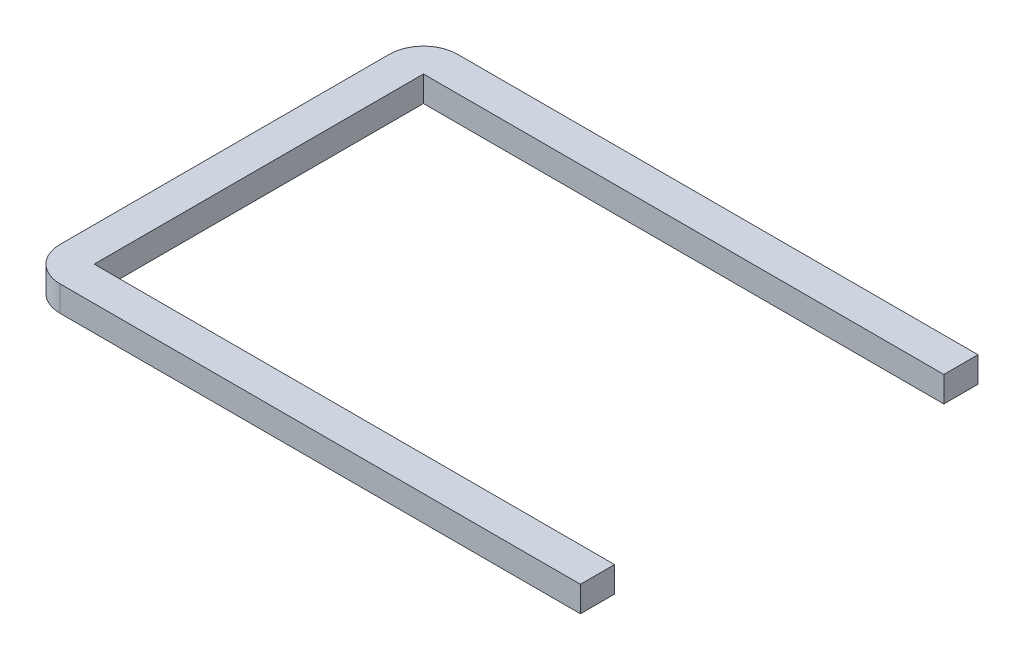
ISO-10303-21;
HEADER;
FILE_DESCRIPTION(('STEP AP214'),'2;1');
FILE_NAME('part.step','',(''),(''),'','','');
FILE_SCHEMA(('AUTOMOTIVE_DESIGN { 1 0 10303 214 1 1 1 1 }'));
ENDSEC;
DATA;
#1=APPLICATION_CONTEXT('core data for automotive mechanical design processes');
#2=APPLICATION_PROTOCOL_DEFINITION('international standard','automotive_design',2000,#1);
#3=PRODUCT_CONTEXT('',#1,'mechanical');
#4=PRODUCT('Part','Part','',(#3));
#5=PRODUCT_RELATED_PRODUCT_CATEGORY('part','',(#4));
#6=PRODUCT_DEFINITION_FORMATION('','',#4);
#7=PRODUCT_DEFINITION_CONTEXT('part definition',#1,'design');
#8=PRODUCT_DEFINITION('design','',#6,#7);
#9=PRODUCT_DEFINITION_SHAPE('','',#8);
#10=(LENGTH_UNIT() NAMED_UNIT(*) SI_UNIT(.MILLI.,.METRE.));
#11=(NAMED_UNIT(*) PLANE_ANGLE_UNIT() SI_UNIT($,.RADIAN.));
#12=(NAMED_UNIT(*) SI_UNIT($,.STERADIAN.) SOLID_ANGLE_UNIT());
#13=UNCERTAINTY_MEASURE_WITH_UNIT(LENGTH_MEASURE(1.E-05),#10,'distance_accuracy_value','');
#14=(GEOMETRIC_REPRESENTATION_CONTEXT(3) GLOBAL_UNCERTAINTY_ASSIGNED_CONTEXT((#13)) GLOBAL_UNIT_ASSIGNED_CONTEXT((#10,
#11,#12)) REPRESENTATION_CONTEXT('',''));
#15=CARTESIAN_POINT('',(0.,0.,0.));
#16=DIRECTION('',(0.,0.,1.));
#17=DIRECTION('',(1.,0.,0.));
#18=AXIS2_PLACEMENT_3D('',#15,#16,#17);
#19=CARTESIAN_POINT('',(0.,7.5,0.));
#20=DIRECTION('',(0.,0.,-1.));
#21=DIRECTION('',(-1.,0.,0.));
#22=AXIS2_PLACEMENT_3D('',#19,#20,#21);
#23=PLANE('',#22);
#24=DIRECTION('',(1.,0.,0.));
#25=VECTOR('',#24,1.);
#26=CARTESIAN_POINT('',(0.,7.5,0.));
#27=LINE('',#26,#25);
#28=CARTESIAN_POINT('',(10.,7.5,0.));
#29=VERTEX_POINT('',#28);
#30=CARTESIAN_POINT('',(162.5,7.5,0.));
#31=VERTEX_POINT('',#30);
#32=EDGE_CURVE('E289',#29,#31,#27,.T.);
#33=ORIENTED_EDGE('',*,*,#32,.F.);
#34=DIRECTION('',(0.,-1.,0.));
#35=VECTOR('',#34,1.);
#36=CARTESIAN_POINT('',(10.,7.5,0.));
#37=LINE('',#36,#35);
#38=CARTESIAN_POINT('',(10.,0.,0.));
#39=VERTEX_POINT('',#38);
#40=EDGE_CURVE('E11',#29,#39,#37,.T.);
#41=ORIENTED_EDGE('',*,*,#40,.T.);
#42=DIRECTION('',(1.,0.,0.));
#43=VECTOR('',#42,1.);
#44=CARTESIAN_POINT('',(0.,0.,0.));
#45=LINE('',#44,#43);
#46=CARTESIAN_POINT('',(162.5,0.,0.));
#47=VERTEX_POINT('',#46);
#48=EDGE_CURVE('E216',#39,#47,#45,.T.);
#49=ORIENTED_EDGE('',*,*,#48,.T.);
#50=DIRECTION('',(0.,-1.,0.));
#51=VECTOR('',#50,1.);
#52=CARTESIAN_POINT('',(162.5,7.5,0.));
#53=LINE('',#52,#51);
#54=EDGE_CURVE('E344',#31,#47,#53,.T.);
#55=ORIENTED_EDGE('',*,*,#54,.F.);
#56=EDGE_LOOP('',(#33,#41,#49,#55));
#57=FACE_BOUND('',#56,.T.);
#58=ADVANCED_FACE('F37',(#57),#23,.F.);
#59=CARTESIAN_POINT('',(162.5,7.5,-10.));
#60=DIRECTION('',(1.,0.,0.));
#61=DIRECTION('',(0.,0.,-1.));
#62=AXIS2_PLACEMENT_3D('',#59,#60,#61);
#63=PLANE('',#62);
#64=DIRECTION('',(0.,0.,1.));
#65=VECTOR('',#64,1.);
#66=CARTESIAN_POINT('',(162.5,0.,-10.));
#67=LINE('',#66,#65);
#68=CARTESIAN_POINT('',(162.5,0.,-10.));
#69=VERTEX_POINT('',#68);
#70=EDGE_CURVE('E315',#69,#47,#67,.T.);
#71=ORIENTED_EDGE('',*,*,#70,.F.);
#72=DIRECTION('',(0.,-1.,0.));
#73=VECTOR('',#72,1.);
#74=CARTESIAN_POINT('',(162.5,7.5,-10.));
#75=LINE('',#74,#73);
#76=CARTESIAN_POINT('',(162.5,7.5,-10.));
#77=VERTEX_POINT('',#76);
#78=EDGE_CURVE('E342',#77,#69,#75,.T.);
#79=ORIENTED_EDGE('',*,*,#78,.F.);
#80=DIRECTION('',(0.,0.,1.));
#81=VECTOR('',#80,1.);
#82=CARTESIAN_POINT('',(162.5,7.5,-10.));
#83=LINE('',#82,#81);
#84=EDGE_CURVE('E291',#77,#31,#83,.T.);
#85=ORIENTED_EDGE('',*,*,#84,.T.);
#86=ORIENTED_EDGE('',*,*,#54,.T.);
#87=EDGE_LOOP('',(#71,#79,#85,#86));
#88=FACE_BOUND('',#87,.T.);
#89=ADVANCED_FACE('F396',(#88),#63,.T.);
#90=CARTESIAN_POINT('',(0.,7.5,-10.));
#91=DIRECTION('',(0.,0.,-1.));
#92=DIRECTION('',(-1.,0.,0.));
#93=AXIS2_PLACEMENT_3D('',#90,#91,#92);
#94=PLANE('',#93);
#95=DIRECTION('',(1.,0.,0.));
#96=VECTOR('',#95,1.);
#97=CARTESIAN_POINT('',(0.,0.,-10.));
#98=LINE('',#97,#96);
#99=CARTESIAN_POINT('',(10.,0.,-10.));
#100=VERTEX_POINT('',#99);
#101=EDGE_CURVE('E318',#100,#69,#98,.T.);
#102=ORIENTED_EDGE('',*,*,#101,.F.);
#103=DIRECTION('',(0.,-1.,0.));
#104=VECTOR('',#103,1.);
#105=CARTESIAN_POINT('',(10.,7.5,-10.));
#106=LINE('',#105,#104);
#107=CARTESIAN_POINT('',(10.,7.5,-10.));
#108=VERTEX_POINT('',#107);
#109=EDGE_CURVE('E340',#108,#100,#106,.T.);
#110=ORIENTED_EDGE('',*,*,#109,.F.);
#111=DIRECTION('',(1.,0.,0.));
#112=VECTOR('',#111,1.);
#113=CARTESIAN_POINT('',(0.,7.5,-10.));
#114=LINE('',#113,#112);
#115=EDGE_CURVE('E295',#108,#77,#114,.T.);
#116=ORIENTED_EDGE('',*,*,#115,.T.);
#117=ORIENTED_EDGE('',*,*,#78,.T.);
#118=EDGE_LOOP('',(#102,#110,#116,#117));
#119=FACE_BOUND('',#118,.T.);
#120=ADVANCED_FACE('F392',(#119),#94,.T.);
#121=CARTESIAN_POINT('',(10.,7.5,0.));
#122=DIRECTION('',(1.,0.,0.));
#123=DIRECTION('',(0.,0.,-1.));
#124=AXIS2_PLACEMENT_3D('',#121,#122,#123);
#125=PLANE('',#124);
#126=DIRECTION('',(0.,0.,-1.));
#127=VECTOR('',#126,1.);
#128=CARTESIAN_POINT('',(10.,0.,0.));
#129=LINE('',#128,#127);
#130=CARTESIAN_POINT('',(10.,0.,-106.5));
#131=VERTEX_POINT('',#130);
#132=EDGE_CURVE('E321',#131,#100,#129,.F.);
#133=ORIENTED_EDGE('',*,*,#132,.F.);
#134=DIRECTION('',(0.,-1.,0.));
#135=VECTOR('',#134,1.);
#136=CARTESIAN_POINT('',(10.,7.5,-106.5));
#137=LINE('',#136,#135);
#138=CARTESIAN_POINT('',(10.,7.5,-106.5));
#139=VERTEX_POINT('',#138);
#140=EDGE_CURVE('E338',#139,#131,#137,.T.);
#141=ORIENTED_EDGE('',*,*,#140,.F.);
#142=DIRECTION('',(0.,0.,-1.));
#143=VECTOR('',#142,1.);
#144=CARTESIAN_POINT('',(10.,7.5,0.));
#145=LINE('',#144,#143);
#146=EDGE_CURVE('E298',#139,#108,#145,.F.);
#147=ORIENTED_EDGE('',*,*,#146,.T.);
#148=ORIENTED_EDGE('',*,*,#109,.T.);
#149=EDGE_LOOP('',(#133,#141,#147,#148));
#150=FACE_BOUND('',#149,.T.);
#151=ADVANCED_FACE('F388',(#150),#125,.T.);
#152=CARTESIAN_POINT('',(0.,7.5,-106.5));
#153=DIRECTION('',(0.,0.,1.));
#154=DIRECTION('',(1.,0.,0.));
#155=AXIS2_PLACEMENT_3D('',#152,#153,#154);
#156=PLANE('',#155);
#157=DIRECTION('',(1.,0.,0.));
#158=VECTOR('',#157,1.);
#159=CARTESIAN_POINT('',(0.,0.,-106.5));
#160=LINE('',#159,#158);
#161=CARTESIAN_POINT('',(162.5,0.,-106.5));
#162=VERTEX_POINT('',#161);
#163=EDGE_CURVE('E324',#162,#131,#160,.F.);
#164=ORIENTED_EDGE('',*,*,#163,.F.);
#165=DIRECTION('',(0.,-1.,0.));
#166=VECTOR('',#165,1.);
#167=CARTESIAN_POINT('',(162.5,7.5,-106.5));
#168=LINE('',#167,#166);
#169=CARTESIAN_POINT('',(162.5,7.5,-106.5));
#170=VERTEX_POINT('',#169);
#171=EDGE_CURVE('E336',#170,#162,#168,.T.);
#172=ORIENTED_EDGE('',*,*,#171,.F.);
#173=DIRECTION('',(1.,0.,0.));
#174=VECTOR('',#173,1.);
#175=CARTESIAN_POINT('',(0.,7.5,-106.5));
#176=LINE('',#175,#174);
#177=EDGE_CURVE('E301',#170,#139,#176,.F.);
#178=ORIENTED_EDGE('',*,*,#177,.T.);
#179=ORIENTED_EDGE('',*,*,#140,.T.);
#180=EDGE_LOOP('',(#164,#172,#178,#179));
#181=FACE_BOUND('',#180,.T.);
#182=ADVANCED_FACE('F384',(#181),#156,.T.);
#183=CARTESIAN_POINT('',(162.5,7.5,-116.5));
#184=DIRECTION('',(1.,0.,0.));
#185=DIRECTION('',(0.,0.,-1.));
#186=AXIS2_PLACEMENT_3D('',#183,#184,#185);
#187=PLANE('',#186);
#188=DIRECTION('',(0.,0.,1.));
#189=VECTOR('',#188,1.);
#190=CARTESIAN_POINT('',(162.5,0.,-116.5));
#191=LINE('',#190,#189);
#192=CARTESIAN_POINT('',(162.5,0.,-116.5));
#193=VERTEX_POINT('',#192);
#194=EDGE_CURVE('E327',#193,#162,#191,.T.);
#195=ORIENTED_EDGE('',*,*,#194,.F.);
#196=DIRECTION('',(0.,-1.,0.));
#197=VECTOR('',#196,1.);
#198=CARTESIAN_POINT('',(162.5,7.5,-116.5));
#199=LINE('',#198,#197);
#200=CARTESIAN_POINT('',(162.5,7.5,-116.5));
#201=VERTEX_POINT('',#200);
#202=EDGE_CURVE('E313',#201,#193,#199,.T.);
#203=ORIENTED_EDGE('',*,*,#202,.F.);
#204=DIRECTION('',(0.,0.,1.));
#205=VECTOR('',#204,1.);
#206=CARTESIAN_POINT('',(162.5,7.5,-116.5));
#207=LINE('',#206,#205);
#208=EDGE_CURVE('E304',#201,#170,#207,.T.);
#209=ORIENTED_EDGE('',*,*,#208,.T.);
#210=ORIENTED_EDGE('',*,*,#171,.T.);
#211=EDGE_LOOP('',(#195,#203,#209,#210));
#212=FACE_BOUND('',#211,.T.);
#213=ADVANCED_FACE('F380',(#212),#187,.T.);
#214=CARTESIAN_POINT('',(0.,7.5,-116.5));
#215=DIRECTION('',(0.,0.,1.));
#216=DIRECTION('',(1.,0.,0.));
#217=AXIS2_PLACEMENT_3D('',#214,#215,#216);
#218=PLANE('',#217);
#219=DIRECTION('',(-1.,0.,0.));
#220=VECTOR('',#219,1.);
#221=CARTESIAN_POINT('',(0.,0.,-116.5));
#222=LINE('',#221,#220);
#223=CARTESIAN_POINT('',(10.,0.,-116.5));
#224=VERTEX_POINT('',#223);
#225=EDGE_CURVE('E330',#193,#224,#222,.T.);
#226=ORIENTED_EDGE('',*,*,#225,.T.);
#227=DIRECTION('',(0.,-1.,0.));
#228=VECTOR('',#227,1.);
#229=CARTESIAN_POINT('',(10.,7.5,-116.5));
#230=LINE('',#229,#228);
#231=CARTESIAN_POINT('',(10.,7.5,-116.5));
#232=VERTEX_POINT('',#231);
#233=EDGE_CURVE('E356',#224,#232,#230,.F.);
#234=ORIENTED_EDGE('',*,*,#233,.T.);
#235=DIRECTION('',(-1.,0.,0.));
#236=VECTOR('',#235,1.);
#237=CARTESIAN_POINT('',(0.,7.5,-116.5));
#238=LINE('',#237,#236);
#239=EDGE_CURVE('E307',#201,#232,#238,.T.);
#240=ORIENTED_EDGE('',*,*,#239,.F.);
#241=ORIENTED_EDGE('',*,*,#202,.T.);
#242=EDGE_LOOP('',(#226,#234,#240,#241));
#243=FACE_BOUND('',#242,.T.);
#244=ADVANCED_FACE('F378',(#243),#218,.F.);
#245=CARTESIAN_POINT('',(0.,7.5,0.));
#246=DIRECTION('',(1.,0.,0.));
#247=DIRECTION('',(0.,0.,-1.));
#248=AXIS2_PLACEMENT_3D('',#245,#246,#247);
#249=PLANE('',#248);
#250=DIRECTION('',(0.,0.,1.));
#251=VECTOR('',#250,1.);
#252=CARTESIAN_POINT('',(0.,7.5,0.));
#253=LINE('',#252,#251);
#254=CARTESIAN_POINT('',(0.,7.5,-106.5));
#255=VERTEX_POINT('',#254);
#256=CARTESIAN_POINT('',(0.,7.5,-10.));
#257=VERTEX_POINT('',#256);
#258=EDGE_CURVE('E310',#255,#257,#253,.T.);
#259=ORIENTED_EDGE('',*,*,#258,.F.);
#260=DIRECTION('',(0.,-1.,0.));
#261=VECTOR('',#260,1.);
#262=CARTESIAN_POINT('',(0.,7.5,-106.5));
#263=LINE('',#262,#261);
#264=CARTESIAN_POINT('',(0.,0.,-106.5));
#265=VERTEX_POINT('',#264);
#266=EDGE_CURVE('E349',#255,#265,#263,.T.);
#267=ORIENTED_EDGE('',*,*,#266,.T.);
#268=DIRECTION('',(0.,0.,1.));
#269=VECTOR('',#268,1.);
#270=CARTESIAN_POINT('',(0.,0.,0.));
#271=LINE('',#270,#269);
#272=CARTESIAN_POINT('',(0.,0.,-10.));
#273=VERTEX_POINT('',#272);
#274=EDGE_CURVE('E292',#265,#273,#271,.T.);
#275=ORIENTED_EDGE('',*,*,#274,.T.);
#276=DIRECTION('',(0.,-1.,0.));
#277=VECTOR('',#276,1.);
#278=CARTESIAN_POINT('',(0.,7.5,-10.));
#279=LINE('',#278,#277);
#280=EDGE_CURVE('E347',#273,#257,#279,.F.);
#281=ORIENTED_EDGE('',*,*,#280,.T.);
#282=EDGE_LOOP('',(#259,#267,#275,#281));
#283=FACE_BOUND('',#282,.T.);
#284=ADVANCED_FACE('F370',(#283),#249,.F.);
#285=CARTESIAN_POINT('',(0.,7.5,0.));
#286=DIRECTION('',(0.,-1.,0.));
#287=DIRECTION('',(-1.,0.,0.));
#288=AXIS2_PLACEMENT_3D('',#285,#286,#287);
#289=PLANE('',#288);
#290=ORIENTED_EDGE('',*,*,#239,.T.);
#291=CARTESIAN_POINT('',(10.,7.5,-106.5));
#292=DIRECTION('',(0.,-1.,0.));
#293=DIRECTION('',(0.,0.,-1.));
#294=AXIS2_PLACEMENT_3D('',#291,#292,#293);
#295=CIRCLE('',#294,10.);
#296=EDGE_CURVE('E45',#232,#255,#295,.F.);
#297=ORIENTED_EDGE('',*,*,#296,.T.);
#298=ORIENTED_EDGE('',*,*,#258,.T.);
#299=CARTESIAN_POINT('',(10.,7.5,-10.));
#300=DIRECTION('',(0.,-1.,0.));
#301=DIRECTION('',(0.,0.,-1.));
#302=AXIS2_PLACEMENT_3D('',#299,#300,#301);
#303=CIRCLE('',#302,10.);
#304=EDGE_CURVE('E358',#257,#29,#303,.F.);
#305=ORIENTED_EDGE('',*,*,#304,.T.);
#306=ORIENTED_EDGE('',*,*,#32,.T.);
#307=ORIENTED_EDGE('',*,*,#84,.F.);
#308=ORIENTED_EDGE('',*,*,#115,.F.);
#309=ORIENTED_EDGE('',*,*,#146,.F.);
#310=ORIENTED_EDGE('',*,*,#177,.F.);
#311=ORIENTED_EDGE('',*,*,#208,.F.);
#312=EDGE_LOOP('',(#290,#297,#298,#305,#306,#307,#308,#309,#310,#311));
#313=FACE_BOUND('',#312,.T.);
#314=ADVANCED_FACE('F362',(#313),#289,.F.);
#315=CARTESIAN_POINT('',(0.,0.,0.));
#316=DIRECTION('',(0.,-1.,0.));
#317=DIRECTION('',(-1.,0.,0.));
#318=AXIS2_PLACEMENT_3D('',#315,#316,#317);
#319=PLANE('',#318);
#320=DIRECTION('',(0.,0.,-1.));
#321=VECTOR('',#320,1.);
#322=CARTESIAN_POINT('',(72.5,0.,-2.5));
#323=LINE('',#322,#321);
#324=CARTESIAN_POINT('',(72.5,0.,-2.5));
#325=VERTEX_POINT('',#324);
#326=CARTESIAN_POINT('',(72.5,0.,-7.5));
#327=VERTEX_POINT('',#326);
#328=EDGE_CURVE('E52',#325,#327,#323,.T.);
#329=ORIENTED_EDGE('',*,*,#328,.F.);
#330=DIRECTION('',(-1.,0.,0.));
#331=VECTOR('',#330,1.);
#332=CARTESIAN_POINT('',(72.5,0.,-2.5));
#333=LINE('',#332,#331);
#334=CARTESIAN_POINT('',(122.5,0.,-2.5));
#335=VERTEX_POINT('',#334);
#336=EDGE_CURVE('E208',#335,#325,#333,.T.);
#337=ORIENTED_EDGE('',*,*,#336,.F.);
#338=DIRECTION('',(0.,0.,1.));
#339=VECTOR('',#338,1.);
#340=CARTESIAN_POINT('',(122.5,0.,-2.5));
#341=LINE('',#340,#339);
#342=CARTESIAN_POINT('',(122.5,0.,-7.5));
#343=VERTEX_POINT('',#342);
#344=EDGE_CURVE('E190',#343,#335,#341,.T.);
#345=ORIENTED_EDGE('',*,*,#344,.F.);
#346=DIRECTION('',(1.,0.,0.));
#347=VECTOR('',#346,1.);
#348=CARTESIAN_POINT('',(72.5,0.,-7.5));
#349=LINE('',#348,#347);
#350=EDGE_CURVE('E201',#327,#343,#349,.T.);
#351=ORIENTED_EDGE('',*,*,#350,.F.);
#352=EDGE_LOOP('',(#329,#337,#345,#351));
#353=FACE_BOUND('',#352,.T.);
#354=DIRECTION('',(0.,0.,-1.));
#355=VECTOR('',#354,1.);
#356=CARTESIAN_POINT('',(2.49999999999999,0.,-33.25));
#357=LINE('',#356,#355);
#358=CARTESIAN_POINT('',(2.49999999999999,0.,-33.25));
#359=VERTEX_POINT('',#358);
#360=CARTESIAN_POINT('',(2.49999999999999,0.,-83.25));
#361=VERTEX_POINT('',#360);
#362=EDGE_CURVE('E60',#359,#361,#357,.T.);
#363=ORIENTED_EDGE('',*,*,#362,.F.);
#364=DIRECTION('',(-1.,0.,0.));
#365=VECTOR('',#364,1.);
#366=CARTESIAN_POINT('',(2.49999999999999,0.,-33.25));
#367=LINE('',#366,#365);
#368=CARTESIAN_POINT('',(7.49999999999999,0.,-33.25));
#369=VERTEX_POINT('',#368);
#370=EDGE_CURVE('E240',#369,#359,#367,.T.);
#371=ORIENTED_EDGE('',*,*,#370,.F.);
#372=DIRECTION('',(0.,0.,1.));
#373=VECTOR('',#372,1.);
#374=CARTESIAN_POINT('',(7.49999999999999,0.,-33.25));
#375=LINE('',#374,#373);
#376=CARTESIAN_POINT('',(7.49999999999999,0.,-83.25));
#377=VERTEX_POINT('',#376);
#378=EDGE_CURVE('E251',#377,#369,#375,.T.);
#379=ORIENTED_EDGE('',*,*,#378,.F.);
#380=DIRECTION('',(1.,0.,0.));
#381=VECTOR('',#380,1.);
#382=CARTESIAN_POINT('',(2.49999999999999,0.,-83.25));
#383=LINE('',#382,#381);
#384=EDGE_CURVE('E254',#361,#377,#383,.T.);
#385=ORIENTED_EDGE('',*,*,#384,.F.);
#386=EDGE_LOOP('',(#363,#371,#379,#385));
#387=FACE_BOUND('',#386,.T.);
#388=DIRECTION('',(0.,0.,-1.));
#389=VECTOR('',#388,1.);
#390=CARTESIAN_POINT('',(72.5,0.,-109.));
#391=LINE('',#390,#389);
#392=CARTESIAN_POINT('',(72.5,0.,-109.));
#393=VERTEX_POINT('',#392);
#394=CARTESIAN_POINT('',(72.5,0.,-114.));
#395=VERTEX_POINT('',#394);
#396=EDGE_CURVE('E248',#393,#395,#391,.T.);
#397=ORIENTED_EDGE('',*,*,#396,.F.);
#398=DIRECTION('',(-1.,0.,0.));
#399=VECTOR('',#398,1.);
#400=CARTESIAN_POINT('',(72.5,0.,-109.));
#401=LINE('',#400,#399);
#402=CARTESIAN_POINT('',(122.5,0.,-109.));
#403=VERTEX_POINT('',#402);
#404=EDGE_CURVE('E271',#403,#393,#401,.T.);
#405=ORIENTED_EDGE('',*,*,#404,.F.);
#406=DIRECTION('',(0.,0.,1.));
#407=VECTOR('',#406,1.);
#408=CARTESIAN_POINT('',(122.5,0.,-109.));
#409=LINE('',#408,#407);
#410=CARTESIAN_POINT('',(122.5,0.,-114.));
#411=VERTEX_POINT('',#410);
#412=EDGE_CURVE('E282',#411,#403,#409,.T.);
#413=ORIENTED_EDGE('',*,*,#412,.F.);
#414=DIRECTION('',(1.,0.,0.));
#415=VECTOR('',#414,1.);
#416=CARTESIAN_POINT('',(72.5,0.,-114.));
#417=LINE('',#416,#415);
#418=EDGE_CURVE('E285',#395,#411,#417,.T.);
#419=ORIENTED_EDGE('',*,*,#418,.F.);
#420=EDGE_LOOP('',(#397,#405,#413,#419));
#421=FACE_BOUND('',#420,.T.);
#422=ORIENTED_EDGE('',*,*,#274,.F.);
#423=CARTESIAN_POINT('',(10.,0.,-106.5));
#424=DIRECTION('',(0.,-1.,0.));
#425=DIRECTION('',(0.,0.,-1.));
#426=AXIS2_PLACEMENT_3D('',#423,#424,#425);
#427=CIRCLE('',#426,10.);
#428=EDGE_CURVE('E354',#265,#224,#427,.T.);
#429=ORIENTED_EDGE('',*,*,#428,.T.);
#430=ORIENTED_EDGE('',*,*,#225,.F.);
#431=ORIENTED_EDGE('',*,*,#194,.T.);
#432=ORIENTED_EDGE('',*,*,#163,.T.);
#433=ORIENTED_EDGE('',*,*,#132,.T.);
#434=ORIENTED_EDGE('',*,*,#101,.T.);
#435=ORIENTED_EDGE('',*,*,#70,.T.);
#436=ORIENTED_EDGE('',*,*,#48,.F.);
#437=CARTESIAN_POINT('',(10.,0.,-10.));
#438=DIRECTION('',(0.,-1.,0.));
#439=DIRECTION('',(0.,0.,-1.));
#440=AXIS2_PLACEMENT_3D('',#437,#438,#439);
#441=CIRCLE('',#440,10.);
#442=EDGE_CURVE('E352',#39,#273,#441,.T.);
#443=ORIENTED_EDGE('',*,*,#442,.T.);
#444=EDGE_LOOP('',(#422,#429,#430,#431,#432,#433,#434,#435,#436,#443));
#445=FACE_BOUND('',#444,.T.);
#446=ADVANCED_FACE('F205',(#353,#387,#421,#445),#319,.T.);
#447=CARTESIAN_POINT('',(10.,7.5,-106.5));
#448=DIRECTION('',(0.,-1.,0.));
#449=DIRECTION('',(0.,0.,-1.));
#450=AXIS2_PLACEMENT_3D('',#447,#448,#449);
#451=CYLINDRICAL_SURFACE('',#450,10.);
#452=ORIENTED_EDGE('',*,*,#296,.F.);
#453=ORIENTED_EDGE('',*,*,#233,.F.);
#454=ORIENTED_EDGE('',*,*,#428,.F.);
#455=ORIENTED_EDGE('',*,*,#266,.F.);
#456=EDGE_LOOP('',(#452,#453,#454,#455));
#457=FACE_BOUND('',#456,.T.);
#458=ADVANCED_FACE('F373',(#457),#451,.T.);
#459=CARTESIAN_POINT('',(10.,7.5,-10.));
#460=DIRECTION('',(0.,-1.,0.));
#461=DIRECTION('',(0.,0.,-1.));
#462=AXIS2_PLACEMENT_3D('',#459,#460,#461);
#463=CYLINDRICAL_SURFACE('',#462,10.);
#464=ORIENTED_EDGE('',*,*,#304,.F.);
#465=ORIENTED_EDGE('',*,*,#280,.F.);
#466=ORIENTED_EDGE('',*,*,#442,.F.);
#467=ORIENTED_EDGE('',*,*,#40,.F.);
#468=EDGE_LOOP('',(#464,#465,#466,#467));
#469=FACE_BOUND('',#468,.T.);
#470=ADVANCED_FACE('F39',(#469),#463,.T.);
#471=CARTESIAN_POINT('',(72.5,0.,-109.));
#472=DIRECTION('',(-0.707106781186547,0.707106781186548,0.));
#473=DIRECTION('',(-0.707106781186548,-0.707106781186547,0.));
#474=AXIS2_PLACEMENT_3D('',#471,#472,#473);
#475=PLANE('',#474);
#476=ORIENTED_EDGE('',*,*,#396,.T.);
#477=DIRECTION('',(-0.577350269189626,-0.577350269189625,-0.577350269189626));
#478=VECTOR('',#477,1.);
#479=CARTESIAN_POINT('',(74.1666666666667,1.66666666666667,-112.333333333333));
#480=LINE('',#479,#478);
#481=CARTESIAN_POINT('',(74.6,2.1,-111.9));
#482=VERTEX_POINT('',#481);
#483=EDGE_CURVE('E268',#482,#395,#480,.T.);
#484=ORIENTED_EDGE('',*,*,#483,.F.);
#485=DIRECTION('',(0.,0.,-1.));
#486=VECTOR('',#485,1.);
#487=CARTESIAN_POINT('',(74.6,2.1,0.));
#488=LINE('',#487,#486);
#489=CARTESIAN_POINT('',(74.6,2.1,-111.1));
#490=VERTEX_POINT('',#489);
#491=EDGE_CURVE('E261',#490,#482,#488,.T.);
#492=ORIENTED_EDGE('',*,*,#491,.F.);
#493=DIRECTION('',(-0.577350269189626,-0.577350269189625,0.577350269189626));
#494=VECTOR('',#493,1.);
#495=CARTESIAN_POINT('',(72.5,0.,-109.));
#496=LINE('',#495,#494);
#497=EDGE_CURVE('E275',#490,#393,#496,.T.);
#498=ORIENTED_EDGE('',*,*,#497,.T.);
#499=EDGE_LOOP('',(#476,#484,#492,#498));
#500=FACE_BOUND('',#499,.T.);
#501=ADVANCED_FACE('F404',(#500),#475,.F.);
#502=CARTESIAN_POINT('',(72.5,0.,-109.));
#503=DIRECTION('',(0.,0.707106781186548,0.707106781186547));
#504=DIRECTION('',(0.,-0.707106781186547,0.707106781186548));
#505=AXIS2_PLACEMENT_3D('',#502,#503,#504);
#506=PLANE('',#505);
#507=ORIENTED_EDGE('',*,*,#404,.T.);
#508=ORIENTED_EDGE('',*,*,#497,.F.);
#509=DIRECTION('',(-1.,0.,0.));
#510=VECTOR('',#509,1.);
#511=CARTESIAN_POINT('',(0.,2.1,-111.1));
#512=LINE('',#511,#510);
#513=CARTESIAN_POINT('',(120.4,2.1,-111.1));
#514=VERTEX_POINT('',#513);
#515=EDGE_CURVE('E265',#514,#490,#512,.T.);
#516=ORIENTED_EDGE('',*,*,#515,.F.);
#517=DIRECTION('',(0.577350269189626,-0.577350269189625,0.577350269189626));
#518=VECTOR('',#517,1.);
#519=CARTESIAN_POINT('',(122.5,0.,-109.));
#520=LINE('',#519,#518);
#521=EDGE_CURVE('E272',#514,#403,#520,.T.);
#522=ORIENTED_EDGE('',*,*,#521,.T.);
#523=EDGE_LOOP('',(#507,#508,#516,#522));
#524=FACE_BOUND('',#523,.T.);
#525=ADVANCED_FACE('F409',(#524),#506,.F.);
#526=CARTESIAN_POINT('',(122.5,0.,-109.));
#527=DIRECTION('',(0.707106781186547,0.707106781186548,0.));
#528=DIRECTION('',(-0.707106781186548,0.707106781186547,0.));
#529=AXIS2_PLACEMENT_3D('',#526,#527,#528);
#530=PLANE('',#529);
#531=ORIENTED_EDGE('',*,*,#412,.T.);
#532=ORIENTED_EDGE('',*,*,#521,.F.);
#533=DIRECTION('',(0.,0.,1.));
#534=VECTOR('',#533,1.);
#535=CARTESIAN_POINT('',(120.4,2.1,0.));
#536=LINE('',#535,#534);
#537=CARTESIAN_POINT('',(120.4,2.1,-111.9));
#538=VERTEX_POINT('',#537);
#539=EDGE_CURVE('E262',#538,#514,#536,.T.);
#540=ORIENTED_EDGE('',*,*,#539,.F.);
#541=DIRECTION('',(0.577350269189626,-0.577350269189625,-0.577350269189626));
#542=VECTOR('',#541,1.);
#543=CARTESIAN_POINT('',(105.833333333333,16.6666666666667,-97.3333333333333));
#544=LINE('',#543,#542);
#545=EDGE_CURVE('E274',#538,#411,#544,.T.);
#546=ORIENTED_EDGE('',*,*,#545,.T.);
#547=EDGE_LOOP('',(#531,#532,#540,#546));
#548=FACE_BOUND('',#547,.T.);
#549=ADVANCED_FACE('F443',(#548),#530,.F.);
#550=CARTESIAN_POINT('',(72.5,0.,-114.));
#551=DIRECTION('',(0.,0.707106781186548,-0.707106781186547));
#552=DIRECTION('',(0.,0.707106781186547,0.707106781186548));
#553=AXIS2_PLACEMENT_3D('',#550,#551,#552);
#554=PLANE('',#553);
#555=ORIENTED_EDGE('',*,*,#418,.T.);
#556=ORIENTED_EDGE('',*,*,#545,.F.);
#557=DIRECTION('',(1.,0.,0.));
#558=VECTOR('',#557,1.);
#559=CARTESIAN_POINT('',(0.,2.1,-111.9));
#560=LINE('',#559,#558);
#561=EDGE_CURVE('E258',#482,#538,#560,.T.);
#562=ORIENTED_EDGE('',*,*,#561,.F.);
#563=ORIENTED_EDGE('',*,*,#483,.T.);
#564=EDGE_LOOP('',(#555,#556,#562,#563));
#565=FACE_BOUND('',#564,.T.);
#566=ADVANCED_FACE('F438',(#565),#554,.F.);
#567=CARTESIAN_POINT('',(0.,2.1,0.));
#568=DIRECTION('',(0.,-1.,0.));
#569=DIRECTION('',(0.,0.,-1.));
#570=AXIS2_PLACEMENT_3D('',#567,#568,#569);
#571=PLANE('',#570);
#572=ORIENTED_EDGE('',*,*,#491,.T.);
#573=ORIENTED_EDGE('',*,*,#561,.T.);
#574=ORIENTED_EDGE('',*,*,#539,.T.);
#575=ORIENTED_EDGE('',*,*,#515,.T.);
#576=EDGE_LOOP('',(#572,#573,#574,#575));
#577=FACE_BOUND('',#576,.T.);
#578=ADVANCED_FACE('F435',(#577),#571,.T.);
#579=CARTESIAN_POINT('',(2.49999999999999,0.,-33.25));
#580=DIRECTION('',(-0.707106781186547,0.707106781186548,0.));
#581=DIRECTION('',(-0.707106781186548,-0.707106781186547,0.));
#582=AXIS2_PLACEMENT_3D('',#579,#580,#581);
#583=PLANE('',#582);
#584=ORIENTED_EDGE('',*,*,#362,.T.);
#585=DIRECTION('',(-0.577350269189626,-0.577350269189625,-0.577350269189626));
#586=VECTOR('',#585,1.);
#587=CARTESIAN_POINT('',(19.1666666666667,16.6666666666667,-66.5833333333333));
#588=LINE('',#587,#586);
#589=CARTESIAN_POINT('',(4.59999999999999,2.1,-81.15));
#590=VERTEX_POINT('',#589);
#591=EDGE_CURVE('E237',#590,#361,#588,.T.);
#592=ORIENTED_EDGE('',*,*,#591,.F.);
#593=DIRECTION('',(0.,0.,-1.));
#594=VECTOR('',#593,1.);
#595=CARTESIAN_POINT('',(4.59999999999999,2.1,0.));
#596=LINE('',#595,#594);
#597=CARTESIAN_POINT('',(4.59999999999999,2.1,-35.35));
#598=VERTEX_POINT('',#597);
#599=EDGE_CURVE('E230',#598,#590,#596,.T.);
#600=ORIENTED_EDGE('',*,*,#599,.F.);
#601=DIRECTION('',(-0.577350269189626,-0.577350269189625,0.577350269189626));
#602=VECTOR('',#601,1.);
#603=CARTESIAN_POINT('',(2.49999999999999,0.,-33.25));
#604=LINE('',#603,#602);
#605=EDGE_CURVE('E244',#598,#359,#604,.T.);
#606=ORIENTED_EDGE('',*,*,#605,.T.);
#607=EDGE_LOOP('',(#584,#592,#600,#606));
#608=FACE_BOUND('',#607,.T.);
#609=ADVANCED_FACE('F437',(#608),#583,.F.);
#610=CARTESIAN_POINT('',(2.49999999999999,0.,-33.25));
#611=DIRECTION('',(0.,0.707106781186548,0.707106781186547));
#612=DIRECTION('',(0.,-0.707106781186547,0.707106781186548));
#613=AXIS2_PLACEMENT_3D('',#610,#611,#612);
#614=PLANE('',#613);
#615=ORIENTED_EDGE('',*,*,#370,.T.);
#616=ORIENTED_EDGE('',*,*,#605,.F.);
#617=DIRECTION('',(-1.,0.,0.));
#618=VECTOR('',#617,1.);
#619=CARTESIAN_POINT('',(0.,2.1,-35.35));
#620=LINE('',#619,#618);
#621=CARTESIAN_POINT('',(5.39999999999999,2.1,-35.35));
#622=VERTEX_POINT('',#621);
#623=EDGE_CURVE('E234',#622,#598,#620,.T.);
#624=ORIENTED_EDGE('',*,*,#623,.F.);
#625=DIRECTION('',(0.577350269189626,-0.577350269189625,0.577350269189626));
#626=VECTOR('',#625,1.);
#627=CARTESIAN_POINT('',(7.49999999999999,0.,-33.25));
#628=LINE('',#627,#626);
#629=EDGE_CURVE('E241',#622,#369,#628,.T.);
#630=ORIENTED_EDGE('',*,*,#629,.T.);
#631=EDGE_LOOP('',(#615,#616,#624,#630));
#632=FACE_BOUND('',#631,.T.);
#633=ADVANCED_FACE('F459',(#632),#614,.F.);
#634=CARTESIAN_POINT('',(7.49999999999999,0.,-33.25));
#635=DIRECTION('',(0.707106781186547,0.707106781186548,0.));
#636=DIRECTION('',(-0.707106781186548,0.707106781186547,0.));
#637=AXIS2_PLACEMENT_3D('',#634,#635,#636);
#638=PLANE('',#637);
#639=ORIENTED_EDGE('',*,*,#378,.T.);
#640=ORIENTED_EDGE('',*,*,#629,.F.);
#641=DIRECTION('',(0.,0.,1.));
#642=VECTOR('',#641,1.);
#643=CARTESIAN_POINT('',(5.39999999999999,2.1,0.));
#644=LINE('',#643,#642);
#645=CARTESIAN_POINT('',(5.39999999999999,2.1,-81.15));
#646=VERTEX_POINT('',#645);
#647=EDGE_CURVE('E231',#646,#622,#644,.T.);
#648=ORIENTED_EDGE('',*,*,#647,.F.);
#649=DIRECTION('',(0.577350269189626,-0.577350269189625,-0.577350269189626));
#650=VECTOR('',#649,1.);
#651=CARTESIAN_POINT('',(5.83333333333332,1.66666666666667,-81.5833333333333));
#652=LINE('',#651,#650);
#653=EDGE_CURVE('E243',#646,#377,#652,.T.);
#654=ORIENTED_EDGE('',*,*,#653,.T.);
#655=EDGE_LOOP('',(#639,#640,#648,#654));
#656=FACE_BOUND('',#655,.T.);
#657=ADVANCED_FACE('F462',(#656),#638,.F.);
#658=CARTESIAN_POINT('',(2.49999999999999,0.,-83.25));
#659=DIRECTION('',(0.,0.707106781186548,-0.707106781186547));
#660=DIRECTION('',(0.,0.707106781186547,0.707106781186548));
#661=AXIS2_PLACEMENT_3D('',#658,#659,#660);
#662=PLANE('',#661);
#663=ORIENTED_EDGE('',*,*,#384,.T.);
#664=ORIENTED_EDGE('',*,*,#653,.F.);
#665=DIRECTION('',(1.,0.,0.));
#666=VECTOR('',#665,1.);
#667=CARTESIAN_POINT('',(0.,2.1,-81.15));
#668=LINE('',#667,#666);
#669=EDGE_CURVE('E227',#590,#646,#668,.T.);
#670=ORIENTED_EDGE('',*,*,#669,.F.);
#671=ORIENTED_EDGE('',*,*,#591,.T.);
#672=EDGE_LOOP('',(#663,#664,#670,#671));
#673=FACE_BOUND('',#672,.T.);
#674=ADVANCED_FACE('F455',(#673),#662,.F.);
#675=CARTESIAN_POINT('',(0.,2.1,0.));
#676=DIRECTION('',(0.,-1.,0.));
#677=DIRECTION('',(0.,0.,-1.));
#678=AXIS2_PLACEMENT_3D('',#675,#676,#677);
#679=PLANE('',#678);
#680=ORIENTED_EDGE('',*,*,#599,.T.);
#681=ORIENTED_EDGE('',*,*,#669,.T.);
#682=ORIENTED_EDGE('',*,*,#647,.T.);
#683=ORIENTED_EDGE('',*,*,#623,.T.);
#684=EDGE_LOOP('',(#680,#681,#682,#683));
#685=FACE_BOUND('',#684,.T.);
#686=ADVANCED_FACE('F451',(#685),#679,.T.);
#687=CARTESIAN_POINT('',(72.5,0.,-2.5));
#688=DIRECTION('',(-0.707106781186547,0.707106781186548,0.));
#689=DIRECTION('',(-0.707106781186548,-0.707106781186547,0.));
#690=AXIS2_PLACEMENT_3D('',#687,#688,#689);
#691=PLANE('',#690);
#692=ORIENTED_EDGE('',*,*,#328,.T.);
#693=DIRECTION('',(-0.577350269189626,-0.577350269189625,-0.577350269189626));
#694=VECTOR('',#693,1.);
#695=CARTESIAN_POINT('',(74.1666666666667,1.66666666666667,-5.83333333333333));
#696=LINE('',#695,#694);
#697=CARTESIAN_POINT('',(74.6,2.1,-5.4));
#698=VERTEX_POINT('',#697);
#699=EDGE_CURVE('E198',#698,#327,#696,.T.);
#700=ORIENTED_EDGE('',*,*,#699,.F.);
#701=DIRECTION('',(0.,0.,-1.));
#702=VECTOR('',#701,1.);
#703=CARTESIAN_POINT('',(74.6,2.1,0.));
#704=LINE('',#703,#702);
#705=CARTESIAN_POINT('',(74.6,2.1,-4.60000000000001));
#706=VERTEX_POINT('',#705);
#707=EDGE_CURVE('E210',#706,#698,#704,.T.);
#708=ORIENTED_EDGE('',*,*,#707,.F.);
#709=DIRECTION('',(-0.577350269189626,-0.577350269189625,0.577350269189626));
#710=VECTOR('',#709,1.);
#711=CARTESIAN_POINT('',(72.5,0.,-2.5));
#712=LINE('',#711,#710);
#713=EDGE_CURVE('E214',#706,#325,#712,.T.);
#714=ORIENTED_EDGE('',*,*,#713,.T.);
#715=EDGE_LOOP('',(#692,#700,#708,#714));
#716=FACE_BOUND('',#715,.T.);
#717=ADVANCED_FACE('F454',(#716),#691,.F.);
#718=CARTESIAN_POINT('',(72.5,0.,-2.5));
#719=DIRECTION('',(0.,0.707106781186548,0.707106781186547));
#720=DIRECTION('',(0.,-0.707106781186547,0.707106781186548));
#721=AXIS2_PLACEMENT_3D('',#718,#719,#720);
#722=PLANE('',#721);
#723=ORIENTED_EDGE('',*,*,#336,.T.);
#724=ORIENTED_EDGE('',*,*,#713,.F.);
#725=DIRECTION('',(-1.,0.,0.));
#726=VECTOR('',#725,1.);
#727=CARTESIAN_POINT('',(0.,2.1,-4.6));
#728=LINE('',#727,#726);
#729=CARTESIAN_POINT('',(120.4,2.1,-4.60000000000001));
#730=VERTEX_POINT('',#729);
#731=EDGE_CURVE('E217',#730,#706,#728,.T.);
#732=ORIENTED_EDGE('',*,*,#731,.F.);
#733=DIRECTION('',(0.577350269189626,-0.577350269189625,0.577350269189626));
#734=VECTOR('',#733,1.);
#735=CARTESIAN_POINT('',(122.5,0.,-2.5));
#736=LINE('',#735,#734);
#737=EDGE_CURVE('E197',#730,#335,#736,.T.);
#738=ORIENTED_EDGE('',*,*,#737,.T.);
#739=EDGE_LOOP('',(#723,#724,#732,#738));
#740=FACE_BOUND('',#739,.T.);
#741=ADVANCED_FACE('F470',(#740),#722,.F.);
#742=CARTESIAN_POINT('',(122.5,0.,-2.5));
#743=DIRECTION('',(0.707106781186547,0.707106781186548,0.));
#744=DIRECTION('',(-0.707106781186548,0.707106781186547,0.));
#745=AXIS2_PLACEMENT_3D('',#742,#743,#744);
#746=PLANE('',#745);
#747=ORIENTED_EDGE('',*,*,#344,.T.);
#748=ORIENTED_EDGE('',*,*,#737,.F.);
#749=DIRECTION('',(0.,0.,1.));
#750=VECTOR('',#749,1.);
#751=CARTESIAN_POINT('',(120.4,2.1,0.));
#752=LINE('',#751,#750);
#753=CARTESIAN_POINT('',(120.4,2.1,-5.4));
#754=VERTEX_POINT('',#753);
#755=EDGE_CURVE('E193',#754,#730,#752,.T.);
#756=ORIENTED_EDGE('',*,*,#755,.F.);
#757=DIRECTION('',(0.577350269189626,-0.577350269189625,-0.577350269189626));
#758=VECTOR('',#757,1.);
#759=CARTESIAN_POINT('',(105.833333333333,16.6666666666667,9.16666666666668));
#760=LINE('',#759,#758);
#761=EDGE_CURVE('E186',#754,#343,#760,.T.);
#762=ORIENTED_EDGE('',*,*,#761,.T.);
#763=EDGE_LOOP('',(#747,#748,#756,#762));
#764=FACE_BOUND('',#763,.T.);
#765=ADVANCED_FACE('F188',(#764),#746,.F.);
#766=CARTESIAN_POINT('',(72.5,0.,-7.5));
#767=DIRECTION('',(0.,0.707106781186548,-0.707106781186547));
#768=DIRECTION('',(0.,0.707106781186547,0.707106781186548));
#769=AXIS2_PLACEMENT_3D('',#766,#767,#768);
#770=PLANE('',#769);
#771=ORIENTED_EDGE('',*,*,#350,.T.);
#772=ORIENTED_EDGE('',*,*,#761,.F.);
#773=DIRECTION('',(1.,0.,0.));
#774=VECTOR('',#773,1.);
#775=CARTESIAN_POINT('',(0.,2.1,-5.4));
#776=LINE('',#775,#774);
#777=EDGE_CURVE('E222',#698,#754,#776,.T.);
#778=ORIENTED_EDGE('',*,*,#777,.F.);
#779=ORIENTED_EDGE('',*,*,#699,.T.);
#780=EDGE_LOOP('',(#771,#772,#778,#779));
#781=FACE_BOUND('',#780,.T.);
#782=ADVANCED_FACE('F202',(#781),#770,.F.);
#783=CARTESIAN_POINT('',(0.,2.1,0.));
#784=DIRECTION('',(0.,-1.,0.));
#785=DIRECTION('',(0.,0.,-1.));
#786=AXIS2_PLACEMENT_3D('',#783,#784,#785);
#787=PLANE('',#786);
#788=ORIENTED_EDGE('',*,*,#707,.T.);
#789=ORIENTED_EDGE('',*,*,#777,.T.);
#790=ORIENTED_EDGE('',*,*,#755,.T.);
#791=ORIENTED_EDGE('',*,*,#731,.T.);
#792=EDGE_LOOP('',(#788,#789,#790,#791));
#793=FACE_BOUND('',#792,.T.);
#794=ADVANCED_FACE('F478',(#793),#787,.T.);
#795=CLOSED_SHELL('',(#58,#89,#120,#151,#182,#213,#244,#284,#314,#446,#458,#470,#501,#525,#549,
#566,#578,#609,#633,#657,#674,#686,#717,#741,#765,#782,#794));
#796=MANIFOLD_SOLID_BREP('B2',#795);
#797=ADVANCED_BREP_SHAPE_REPRESENTATION('',(#18,#796),#14);
#798=SHAPE_DEFINITION_REPRESENTATION(#9,#797);
ENDSEC;
END-ISO-10303-21;
